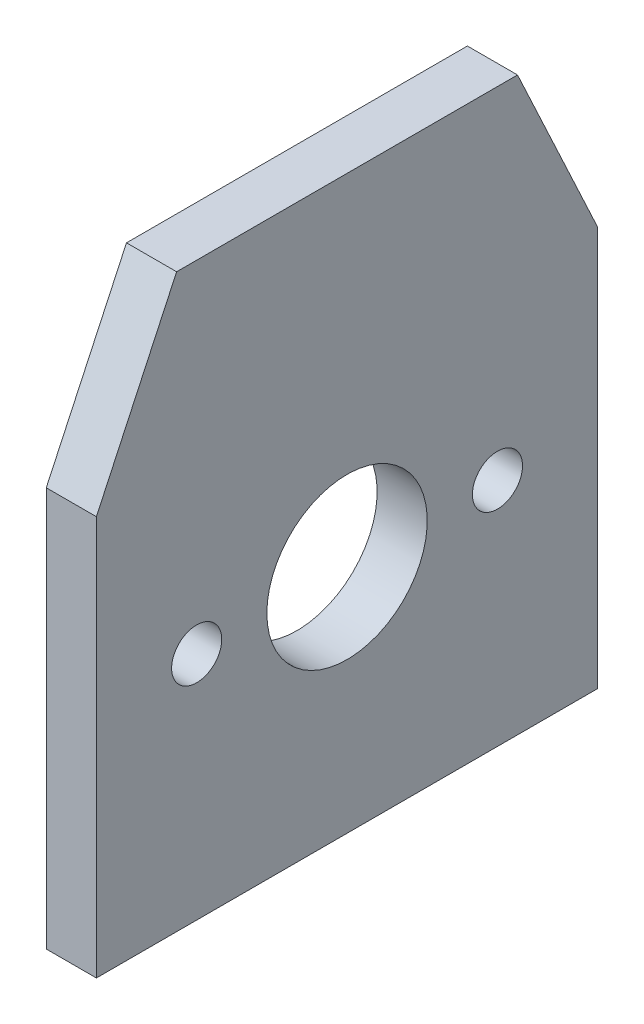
from build123d import *

# Parameters (mm, degrees)
BOSS_EXTRUDE1_DEPTH = 5
SKETCH2_R           = 8
SKETCH2_R_2         = 2.5
CUT_EXTRUDE1_DEPTH  = 63.441973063


with BuildPart() as part:
    # Sketch1 → Boss-Extrude1 (new body)
    with BuildSketch(Plane(origin=(0, 0, 0), x_dir=(0, 0, -1), z_dir=(1, 0, 0))):
        Polygon((-25, 39.843944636), (-17, 57), (17, 57), (25, 39.843944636), (25, 0), (-25, 0), align=None)
    extrude(amount=BOSS_EXTRUDE1_DEPTH)

    # Sketch2 → Cut-Extrude1 (cut, through all)
    with BuildSketch(Plane.ZY):
        with Locations((0, 23)):
            Circle(SKETCH2_R)
        with Locations((-15, 23)):
            Circle(SKETCH2_R_2)
        with Locations((15, 23)):
            Circle(SKETCH2_R_2)
    extrude(amount=-CUT_EXTRUDE1_DEPTH, mode=Mode.SUBTRACT)


solid = part.part
